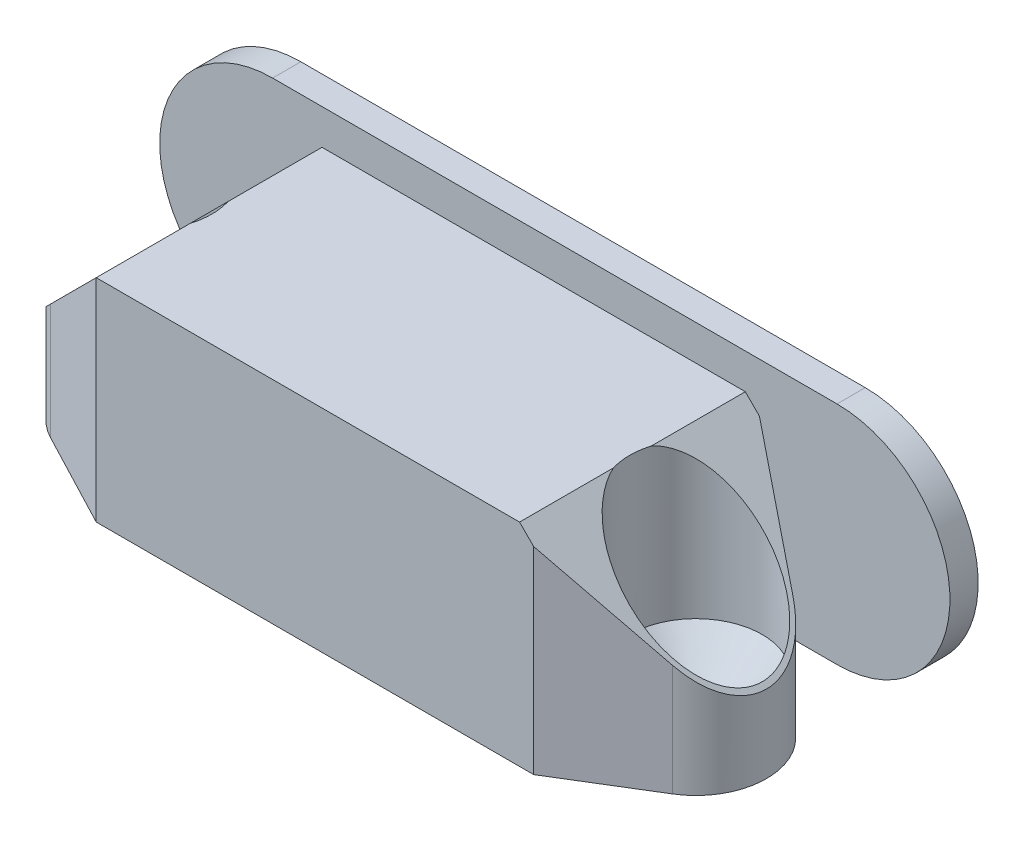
ISO-10303-21;
HEADER;
FILE_DESCRIPTION(('STEP AP214'),'2;1');
FILE_NAME('part.step','',(''),(''),'','','');
FILE_SCHEMA(('AUTOMOTIVE_DESIGN { 1 0 10303 214 1 1 1 1 }'));
ENDSEC;
DATA;
#1=APPLICATION_CONTEXT('core data for automotive mechanical design processes');
#2=APPLICATION_PROTOCOL_DEFINITION('international standard','automotive_design',2000,#1);
#3=PRODUCT_CONTEXT('',#1,'mechanical');
#4=PRODUCT('Part','Part','',(#3));
#5=PRODUCT_RELATED_PRODUCT_CATEGORY('part','',(#4));
#6=PRODUCT_DEFINITION_FORMATION('','',#4);
#7=PRODUCT_DEFINITION_CONTEXT('part definition',#1,'design');
#8=PRODUCT_DEFINITION('design','',#6,#7);
#9=PRODUCT_DEFINITION_SHAPE('','',#8);
#10=(LENGTH_UNIT() NAMED_UNIT(*) SI_UNIT(.MILLI.,.METRE.));
#11=(NAMED_UNIT(*) PLANE_ANGLE_UNIT() SI_UNIT($,.RADIAN.));
#12=(NAMED_UNIT(*) SI_UNIT($,.STERADIAN.) SOLID_ANGLE_UNIT());
#13=UNCERTAINTY_MEASURE_WITH_UNIT(LENGTH_MEASURE(1.E-05),#10,'distance_accuracy_value','');
#14=(GEOMETRIC_REPRESENTATION_CONTEXT(3) GLOBAL_UNCERTAINTY_ASSIGNED_CONTEXT((#13)) GLOBAL_UNIT_ASSIGNED_CONTEXT((#10,
#11,#12)) REPRESENTATION_CONTEXT('',''));
#15=CARTESIAN_POINT('',(0.,0.,0.));
#16=DIRECTION('',(0.,0.,1.));
#17=DIRECTION('',(1.,0.,0.));
#18=AXIS2_PLACEMENT_3D('',#15,#16,#17);
#19=CARTESIAN_POINT('',(16.,7.,19.5));
#20=DIRECTION('',(0.,0.,1.));
#21=DIRECTION('',(1.,0.,0.));
#22=AXIS2_PLACEMENT_3D('',#19,#20,#21);
#23=PLANE('',#22);
#24=DIRECTION('',(0.,-1.,0.));
#25=VECTOR('',#24,1.);
#26=CARTESIAN_POINT('',(16.,7.,19.5));
#27=LINE('',#26,#25);
#28=CARTESIAN_POINT('',(16.,6.,19.5));
#29=VERTEX_POINT('',#28);
#30=CARTESIAN_POINT('',(16.,-8.,19.5));
#31=VERTEX_POINT('',#30);
#32=EDGE_CURVE('E235',#29,#31,#27,.T.);
#33=ORIENTED_EDGE('',*,*,#32,.F.);
#34=DIRECTION('',(-0.707106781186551,0.707106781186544,0.));
#35=VECTOR('',#34,1.);
#36=CARTESIAN_POINT('',(15.,7.,19.5));
#37=LINE('',#36,#35);
#38=CARTESIAN_POINT('',(15.,7.,19.5));
#39=VERTEX_POINT('',#38);
#40=EDGE_CURVE('E150',#29,#39,#37,.T.);
#41=ORIENTED_EDGE('',*,*,#40,.T.);
#42=DIRECTION('',(-1.,0.,0.));
#43=VECTOR('',#42,1.);
#44=CARTESIAN_POINT('',(16.,7.,19.5));
#45=LINE('',#44,#43);
#46=CARTESIAN_POINT('',(-15.,7.,19.5));
#47=VERTEX_POINT('',#46);
#48=EDGE_CURVE('E222',#39,#47,#45,.T.);
#49=ORIENTED_EDGE('',*,*,#48,.T.);
#50=DIRECTION('',(0.,-1.,0.));
#51=VECTOR('',#50,1.);
#52=CARTESIAN_POINT('',(-15.,7.,19.5));
#53=LINE('',#52,#51);
#54=CARTESIAN_POINT('',(-15.,-8.,19.5));
#55=VERTEX_POINT('',#54);
#56=EDGE_CURVE('E232',#47,#55,#53,.T.);
#57=ORIENTED_EDGE('',*,*,#56,.T.);
#58=DIRECTION('',(-1.,0.,0.));
#59=VECTOR('',#58,1.);
#60=CARTESIAN_POINT('',(16.,-8.,19.5));
#61=LINE('',#60,#59);
#62=EDGE_CURVE('E207',#31,#55,#61,.T.);
#63=ORIENTED_EDGE('',*,*,#62,.F.);
#64=EDGE_LOOP('',(#33,#41,#49,#57,#63));
#65=FACE_BOUND('',#64,.T.);
#66=ADVANCED_FACE('F46',(#65),#23,.T.);
#67=CARTESIAN_POINT('',(22.1079530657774,7.,15.7659794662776));
#68=DIRECTION('',(0.521590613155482,0.,0.853195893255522));
#69=DIRECTION('',(0.853195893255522,0.,-0.521590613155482));
#70=AXIS2_PLACEMENT_3D('',#67,#68,#69);
#71=PLANE('',#70);
#72=DIRECTION('',(0.,-1.,0.));
#73=VECTOR('',#72,1.);
#74=CARTESIAN_POINT('',(22.1079530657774,7.,15.7659794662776));
#75=LINE('',#74,#73);
#76=CARTESIAN_POINT('',(22.1079530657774,-0.107953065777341,15.7659794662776));
#77=VERTEX_POINT('',#76);
#78=CARTESIAN_POINT('',(22.1079530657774,-8.,15.7659794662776));
#79=VERTEX_POINT('',#78);
#80=EDGE_CURVE('E238',#77,#79,#75,.T.);
#81=ORIENTED_EDGE('',*,*,#80,.F.);
#82=DIRECTION('',(0.649058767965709,-0.649058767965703,-0.396793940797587));
#83=VECTOR('',#82,1.);
#84=CARTESIAN_POINT('',(19.2783843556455,2.72161564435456,17.4958008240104));
#85=LINE('',#84,#83);
#86=EDGE_CURVE('E291',#29,#77,#85,.T.);
#87=ORIENTED_EDGE('',*,*,#86,.F.);
#88=ORIENTED_EDGE('',*,*,#32,.T.);
#89=DIRECTION('',(-0.853195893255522,0.,0.521590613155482));
#90=VECTOR('',#89,1.);
#91=CARTESIAN_POINT('',(22.1079530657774,-8.,15.7659794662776));
#92=LINE('',#91,#90);
#93=EDGE_CURVE('E203',#79,#31,#92,.T.);
#94=ORIENTED_EDGE('',*,*,#93,.F.);
#95=EDGE_LOOP('',(#81,#87,#88,#94));
#96=FACE_BOUND('',#95,.T.);
#97=ADVANCED_FACE('F288',(#96),#71,.T.);
#98=CARTESIAN_POINT('',(19.5,7.,11.5));
#99=DIRECTION('',(0.,-1.,0.));
#100=DIRECTION('',(1.,0.,0.));
#101=AXIS2_PLACEMENT_3D('',#98,#99,#100);
#102=CYLINDRICAL_SURFACE('',#101,5.);
#103=DIRECTION('',(0.,-1.,0.));
#104=VECTOR('',#103,1.);
#105=CARTESIAN_POINT('',(22.1079530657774,7.,7.23402053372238));
#106=LINE('',#105,#104);
#107=CARTESIAN_POINT('',(22.1079530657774,-0.107953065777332,7.23402053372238));
#108=VERTEX_POINT('',#107);
#109=CARTESIAN_POINT('',(22.1079530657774,-8.,7.23402053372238));
#110=VERTEX_POINT('',#109);
#111=EDGE_CURVE('E241',#108,#110,#106,.T.);
#112=ORIENTED_EDGE('',*,*,#111,.F.);
#113=CARTESIAN_POINT('',(19.5,2.50000000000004,11.5));
#114=DIRECTION('',(0.707106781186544,0.707106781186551,0.));
#115=DIRECTION('',(0.707106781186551,-0.707106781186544,0.));
#116=AXIS2_PLACEMENT_3D('',#113,#114,#115);
#117=ELLIPSE('',#116,7.07106781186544,5.);
#118=EDGE_CURVE('E155',#77,#108,#117,.T.);
#119=ORIENTED_EDGE('',*,*,#118,.F.);
#120=ORIENTED_EDGE('',*,*,#80,.T.);
#121=CARTESIAN_POINT('',(19.5,-8.,11.5));
#122=DIRECTION('',(0.,-1.,0.));
#123=DIRECTION('',(1.,0.,0.));
#124=AXIS2_PLACEMENT_3D('',#121,#122,#123);
#125=CIRCLE('',#124,5.);
#126=EDGE_CURVE('E199',#110,#79,#125,.T.);
#127=ORIENTED_EDGE('',*,*,#126,.F.);
#128=EDGE_LOOP('',(#112,#119,#120,#127));
#129=FACE_BOUND('',#128,.T.);
#130=ADVANCED_FACE('F283',(#129),#102,.T.);
#131=CARTESIAN_POINT('',(16.,7.,3.5));
#132=DIRECTION('',(0.52159061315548,0.,-0.853195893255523));
#133=DIRECTION('',(-0.853195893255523,0.,-0.52159061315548));
#134=AXIS2_PLACEMENT_3D('',#131,#132,#133);
#135=PLANE('',#134);
#136=DIRECTION('',(0.,-1.,0.));
#137=VECTOR('',#136,1.);
#138=CARTESIAN_POINT('',(16.,7.,3.5));
#139=LINE('',#138,#137);
#140=CARTESIAN_POINT('',(16.,6.00000000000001,3.5));
#141=VERTEX_POINT('',#140);
#142=CARTESIAN_POINT('',(16.,-8.,3.5));
#143=VERTEX_POINT('',#142);
#144=EDGE_CURVE('E244',#141,#143,#139,.T.);
#145=ORIENTED_EDGE('',*,*,#144,.F.);
#146=DIRECTION('',(-0.64905876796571,0.649058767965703,-0.396793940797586));
#147=VECTOR('',#146,1.);
#148=CARTESIAN_POINT('',(15.1571878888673,6.84281211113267,2.98475738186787));
#149=LINE('',#148,#147);
#150=EDGE_CURVE('E147',#108,#141,#149,.T.);
#151=ORIENTED_EDGE('',*,*,#150,.F.);
#152=ORIENTED_EDGE('',*,*,#111,.T.);
#153=DIRECTION('',(0.853195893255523,0.,0.52159061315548));
#154=VECTOR('',#153,1.);
#155=CARTESIAN_POINT('',(16.,-8.,3.5));
#156=LINE('',#155,#154);
#157=EDGE_CURVE('E195',#143,#110,#156,.T.);
#158=ORIENTED_EDGE('',*,*,#157,.F.);
#159=EDGE_LOOP('',(#145,#151,#152,#158));
#160=FACE_BOUND('',#159,.T.);
#161=ADVANCED_FACE('F278',(#160),#135,.T.);
#162=CARTESIAN_POINT('',(-15.,7.,3.5));
#163=DIRECTION('',(0.,0.,-1.));
#164=DIRECTION('',(-1.,0.,0.));
#165=AXIS2_PLACEMENT_3D('',#162,#163,#164);
#166=PLANE('',#165);
#167=DIRECTION('',(1.,0.,0.));
#168=VECTOR('',#167,1.);
#169=CARTESIAN_POINT('',(-15.,7.,3.5));
#170=LINE('',#169,#168);
#171=CARTESIAN_POINT('',(-15.,7.,3.5));
#172=VERTEX_POINT('',#171);
#173=CARTESIAN_POINT('',(15.,7.,3.5));
#174=VERTEX_POINT('',#173);
#175=EDGE_CURVE('E219',#172,#174,#170,.T.);
#176=ORIENTED_EDGE('',*,*,#175,.T.);
#177=DIRECTION('',(-0.707106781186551,0.707106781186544,0.));
#178=VECTOR('',#177,1.);
#179=CARTESIAN_POINT('',(15.,7.,3.5));
#180=LINE('',#179,#178);
#181=EDGE_CURVE('E69',#141,#174,#180,.T.);
#182=ORIENTED_EDGE('',*,*,#181,.F.);
#183=ORIENTED_EDGE('',*,*,#144,.T.);
#184=DIRECTION('',(1.,0.,0.));
#185=VECTOR('',#184,1.);
#186=CARTESIAN_POINT('',(-15.,-8.,3.5));
#187=LINE('',#186,#185);
#188=CARTESIAN_POINT('',(-15.,-8.,3.5));
#189=VERTEX_POINT('',#188);
#190=EDGE_CURVE('E191',#189,#143,#187,.T.);
#191=ORIENTED_EDGE('',*,*,#190,.F.);
#192=DIRECTION('',(0.,-1.,0.));
#193=VECTOR('',#192,1.);
#194=CARTESIAN_POINT('',(-15.,7.,3.5));
#195=LINE('',#194,#193);
#196=EDGE_CURVE('E225',#172,#189,#195,.T.);
#197=ORIENTED_EDGE('',*,*,#196,.F.);
#198=EDGE_LOOP('',(#176,#182,#183,#191,#197));
#199=FACE_BOUND('',#198,.T.);
#200=ADVANCED_FACE('F273',(#199),#166,.T.);
#201=CARTESIAN_POINT('',(19.5,7.,11.5));
#202=DIRECTION('',(0.,-1.,0.));
#203=DIRECTION('',(1.,0.,0.));
#204=AXIS2_PLACEMENT_3D('',#201,#202,#203);
#205=PLANE('',#204);
#206=DIRECTION('',(0.,0.,1.));
#207=VECTOR('',#206,1.);
#208=CARTESIAN_POINT('',(15.,7.,3.499));
#209=LINE('',#208,#207);
#210=CARTESIAN_POINT('',(15.,7.,12.8564659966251));
#211=VERTEX_POINT('',#210);
#212=EDGE_CURVE('E137',#211,#39,#209,.T.);
#213=ORIENTED_EDGE('',*,*,#212,.F.);
#214=CARTESIAN_POINT('',(19.5,7.,11.5));
#215=DIRECTION('',(0.,1.,0.));
#216=DIRECTION('',(0.,0.,1.));
#217=AXIS2_PLACEMENT_3D('',#214,#215,#216);
#218=CIRCLE('',#217,4.7);
#219=CARTESIAN_POINT('',(15.,7.,10.1435340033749));
#220=VERTEX_POINT('',#219);
#221=EDGE_CURVE('E61',#220,#211,#218,.T.);
#222=ORIENTED_EDGE('',*,*,#221,.F.);
#223=EDGE_CURVE('E134',#174,#220,#209,.T.);
#224=ORIENTED_EDGE('',*,*,#223,.F.);
#225=ORIENTED_EDGE('',*,*,#175,.F.);
#226=DIRECTION('',(0.,0.,1.));
#227=VECTOR('',#226,1.);
#228=CARTESIAN_POINT('',(-15.,7.,-0.001000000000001));
#229=LINE('',#228,#227);
#230=CARTESIAN_POINT('',(-15.,7.,10.1435340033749));
#231=VERTEX_POINT('',#230);
#232=EDGE_CURVE('E175',#172,#231,#229,.T.);
#233=ORIENTED_EDGE('',*,*,#232,.T.);
#234=CARTESIAN_POINT('',(-19.5,7.,11.5));
#235=DIRECTION('',(0.,1.,0.));
#236=DIRECTION('',(0.,0.,1.));
#237=AXIS2_PLACEMENT_3D('',#234,#235,#236);
#238=CIRCLE('',#237,4.7);
#239=CARTESIAN_POINT('',(-15.,7.,12.8564659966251));
#240=VERTEX_POINT('',#239);
#241=EDGE_CURVE('E158',#240,#231,#238,.T.);
#242=ORIENTED_EDGE('',*,*,#241,.F.);
#243=EDGE_CURVE('E174',#240,#47,#229,.T.);
#244=ORIENTED_EDGE('',*,*,#243,.T.);
#245=ORIENTED_EDGE('',*,*,#48,.F.);
#246=EDGE_LOOP('',(#213,#222,#224,#225,#233,#242,#244,#245));
#247=FACE_BOUND('',#246,.T.);
#248=ADVANCED_FACE('F132',(#247),#205,.F.);
#249=CARTESIAN_POINT('',(-21.8192413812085,7.,7.07042672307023));
#250=DIRECTION('',(-0.463848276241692,0.,-0.885914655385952));
#251=DIRECTION('',(-0.885914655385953,0.,0.463848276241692));
#252=AXIS2_PLACEMENT_3D('',#249,#250,#251);
#253=PLANE('',#252);
#254=DIRECTION('',(0.663119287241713,0.663119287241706,-0.347196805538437));
#255=VECTOR('',#254,1.);
#256=CARTESIAN_POINT('',(-14.1939546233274,7.80604537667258,3.07796977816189));
#257=LINE('',#256,#255);
#258=CARTESIAN_POINT('',(-21.8192413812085,0.180758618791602,7.07042672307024));
#259=VERTEX_POINT('',#258);
#260=EDGE_CURVE('E183',#259,#172,#257,.T.);
#261=ORIENTED_EDGE('',*,*,#260,.T.);
#262=ORIENTED_EDGE('',*,*,#196,.T.);
#263=DIRECTION('',(0.885914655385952,0.,-0.463848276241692));
#264=VECTOR('',#263,1.);
#265=CARTESIAN_POINT('',(-21.8192413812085,-8.,7.07042672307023));
#266=LINE('',#265,#264);
#267=CARTESIAN_POINT('',(-21.8192413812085,-8.,7.07042672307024));
#268=VERTEX_POINT('',#267);
#269=EDGE_CURVE('E187',#268,#189,#266,.T.);
#270=ORIENTED_EDGE('',*,*,#269,.F.);
#271=DIRECTION('',(0.,-1.,0.));
#272=VECTOR('',#271,1.);
#273=CARTESIAN_POINT('',(-21.8192413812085,7.,7.07042672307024));
#274=LINE('',#273,#272);
#275=EDGE_CURVE('E226',#259,#268,#274,.T.);
#276=ORIENTED_EDGE('',*,*,#275,.F.);
#277=EDGE_LOOP('',(#261,#262,#270,#276));
#278=FACE_BOUND('',#277,.T.);
#279=ADVANCED_FACE('F48',(#278),#253,.T.);
#280=CARTESIAN_POINT('',(-19.5,7.,11.5));
#281=DIRECTION('',(0.,-1.,0.));
#282=DIRECTION('',(1.,0.,0.));
#283=AXIS2_PLACEMENT_3D('',#280,#281,#282);
#284=CYLINDRICAL_SURFACE('',#283,5.);
#285=CARTESIAN_POINT('',(-19.5,2.50000000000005,11.5));
#286=DIRECTION('',(0.707106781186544,-0.707106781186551,0.));
#287=DIRECTION('',(-0.707106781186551,-0.707106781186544,0.));
#288=AXIS2_PLACEMENT_3D('',#285,#286,#287);
#289=ELLIPSE('',#288,7.07106781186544,5.);
#290=CARTESIAN_POINT('',(-21.8192413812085,0.180758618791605,15.9295732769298));
#291=VERTEX_POINT('',#290);
#292=EDGE_CURVE('E179',#291,#259,#289,.T.);
#293=ORIENTED_EDGE('',*,*,#292,.T.);
#294=ORIENTED_EDGE('',*,*,#275,.T.);
#295=CARTESIAN_POINT('',(-19.5,-8.,11.5));
#296=DIRECTION('',(0.,-1.,0.));
#297=DIRECTION('',(1.,0.,0.));
#298=AXIS2_PLACEMENT_3D('',#295,#296,#297);
#299=CIRCLE('',#298,5.);
#300=CARTESIAN_POINT('',(-21.8192413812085,-8.,15.9295732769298));
#301=VERTEX_POINT('',#300);
#302=EDGE_CURVE('E215',#301,#268,#299,.T.);
#303=ORIENTED_EDGE('',*,*,#302,.F.);
#304=DIRECTION('',(0.,-1.,0.));
#305=VECTOR('',#304,1.);
#306=CARTESIAN_POINT('',(-21.8192413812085,7.,15.9295732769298));
#307=LINE('',#306,#305);
#308=EDGE_CURVE('E229',#291,#301,#307,.T.);
#309=ORIENTED_EDGE('',*,*,#308,.F.);
#310=EDGE_LOOP('',(#293,#294,#303,#309));
#311=FACE_BOUND('',#310,.T.);
#312=ADVANCED_FACE('F299',(#311),#284,.T.);
#313=CARTESIAN_POINT('',(-15.,7.,19.5));
#314=DIRECTION('',(-0.463848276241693,0.,0.885914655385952));
#315=DIRECTION('',(0.885914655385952,0.,0.463848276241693));
#316=AXIS2_PLACEMENT_3D('',#313,#314,#315);
#317=PLANE('',#316);
#318=DIRECTION('',(-0.663119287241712,-0.663119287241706,-0.347196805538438));
#319=VECTOR('',#318,1.);
#320=CARTESIAN_POINT('',(-19.4897717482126,2.51022825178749,17.1492398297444));
#321=LINE('',#320,#319);
#322=EDGE_CURVE('E170',#47,#291,#321,.T.);
#323=ORIENTED_EDGE('',*,*,#322,.T.);
#324=ORIENTED_EDGE('',*,*,#308,.T.);
#325=DIRECTION('',(-0.885914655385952,0.,-0.463848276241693));
#326=VECTOR('',#325,1.);
#327=CARTESIAN_POINT('',(-15.,-8.,19.5));
#328=LINE('',#327,#326);
#329=EDGE_CURVE('E211',#55,#301,#328,.T.);
#330=ORIENTED_EDGE('',*,*,#329,.F.);
#331=ORIENTED_EDGE('',*,*,#56,.F.);
#332=EDGE_LOOP('',(#323,#324,#330,#331));
#333=FACE_BOUND('',#332,.T.);
#334=ADVANCED_FACE('F263',(#333),#317,.T.);
#335=CARTESIAN_POINT('',(19.5,-8.,11.5));
#336=DIRECTION('',(0.,-1.,0.));
#337=DIRECTION('',(1.,0.,0.));
#338=AXIS2_PLACEMENT_3D('',#335,#336,#337);
#339=PLANE('',#338);
#340=CARTESIAN_POINT('',(19.5,-8.,11.5));
#341=DIRECTION('',(0.,-1.,0.));
#342=DIRECTION('',(1.,0.,0.));
#343=AXIS2_PLACEMENT_3D('',#340,#341,#342);
#344=CIRCLE('',#343,2.15);
#345=CARTESIAN_POINT('',(21.65,-8.,11.5));
#346=VERTEX_POINT('',#345);
#347=EDGE_CURVE('E50',#346,#346,#344,.T.);
#348=ORIENTED_EDGE('',*,*,#347,.F.);
#349=EDGE_LOOP('',(#348));
#350=FACE_BOUND('',#349,.T.);
#351=CARTESIAN_POINT('',(-19.5,-8.,11.5));
#352=DIRECTION('',(0.,-1.,0.));
#353=DIRECTION('',(1.,0.,0.));
#354=AXIS2_PLACEMENT_3D('',#351,#352,#353);
#355=CIRCLE('',#354,2.15);
#356=CARTESIAN_POINT('',(-17.35,-8.,11.5));
#357=VERTEX_POINT('',#356);
#358=EDGE_CURVE('E169',#357,#357,#355,.T.);
#359=ORIENTED_EDGE('',*,*,#358,.F.);
#360=EDGE_LOOP('',(#359));
#361=FACE_BOUND('',#360,.T.);
#362=ORIENTED_EDGE('',*,*,#269,.T.);
#363=ORIENTED_EDGE('',*,*,#190,.T.);
#364=ORIENTED_EDGE('',*,*,#157,.T.);
#365=ORIENTED_EDGE('',*,*,#126,.T.);
#366=ORIENTED_EDGE('',*,*,#93,.T.);
#367=ORIENTED_EDGE('',*,*,#62,.T.);
#368=ORIENTED_EDGE('',*,*,#329,.T.);
#369=ORIENTED_EDGE('',*,*,#302,.T.);
#370=EDGE_LOOP('',(#362,#363,#364,#365,#366,#367,#368,#369));
#371=FACE_BOUND('',#370,.T.);
#372=ADVANCED_FACE('F259',(#350,#361,#371),#339,.T.);
#373=CARTESIAN_POINT('',(-15.,7.,-0.001000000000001));
#374=DIRECTION('',(0.707106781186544,-0.707106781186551,0.));
#375=DIRECTION('',(0.707106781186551,0.707106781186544,0.));
#376=AXIS2_PLACEMENT_3D('',#373,#374,#375);
#377=PLANE('',#376);
#378=ORIENTED_EDGE('',*,*,#243,.F.);
#379=CARTESIAN_POINT('',(-19.5,2.50000000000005,11.5));
#380=DIRECTION('',(0.707106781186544,-0.707106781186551,0.));
#381=DIRECTION('',(0.707106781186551,0.707106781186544,0.));
#382=AXIS2_PLACEMENT_3D('',#379,#380,#381);
#383=ELLIPSE('',#382,6.64680374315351,4.7);
#384=EDGE_CURVE('E56',#240,#231,#383,.T.);
#385=ORIENTED_EDGE('',*,*,#384,.T.);
#386=ORIENTED_EDGE('',*,*,#232,.F.);
#387=ORIENTED_EDGE('',*,*,#260,.F.);
#388=ORIENTED_EDGE('',*,*,#292,.F.);
#389=ORIENTED_EDGE('',*,*,#322,.F.);
#390=EDGE_LOOP('',(#378,#385,#386,#387,#388,#389));
#391=FACE_BOUND('',#390,.T.);
#392=ADVANCED_FACE('F262',(#391),#377,.F.);
#393=CARTESIAN_POINT('',(-19.5,7.,11.5));
#394=DIRECTION('',(0.,1.,0.));
#395=DIRECTION('',(0.,0.,1.));
#396=AXIS2_PLACEMENT_3D('',#393,#394,#395);
#397=CYLINDRICAL_SURFACE('',#396,4.7);
#398=CARTESIAN_POINT('',(-19.5,-4.,11.5));
#399=DIRECTION('',(0.,1.,0.));
#400=DIRECTION('',(0.,0.,1.));
#401=AXIS2_PLACEMENT_3D('',#398,#399,#400);
#402=CIRCLE('',#401,4.7);
#403=CARTESIAN_POINT('',(-19.5,-4.,16.2));
#404=VERTEX_POINT('',#403);
#405=EDGE_CURVE('E161',#404,#404,#402,.T.);
#406=ORIENTED_EDGE('',*,*,#405,.F.);
#407=EDGE_LOOP('',(#406));
#408=FACE_BOUND('',#407,.T.);
#409=ORIENTED_EDGE('',*,*,#241,.T.);
#410=ORIENTED_EDGE('',*,*,#384,.F.);
#411=EDGE_LOOP('',(#409,#410));
#412=FACE_BOUND('',#411,.T.);
#413=ADVANCED_FACE('F330',(#408,#412),#397,.F.);
#414=CARTESIAN_POINT('',(-19.5,7.,11.5));
#415=DIRECTION('',(0.,1.,0.));
#416=DIRECTION('',(0.,0.,1.));
#417=AXIS2_PLACEMENT_3D('',#414,#415,#416);
#418=CYLINDRICAL_SURFACE('',#417,2.15);
#419=ORIENTED_EDGE('',*,*,#358,.T.);
#420=EDGE_LOOP('',(#419));
#421=FACE_BOUND('',#420,.T.);
#422=CARTESIAN_POINT('',(-19.5,-6.55,11.5));
#423=DIRECTION('',(0.,1.,0.));
#424=DIRECTION('',(0.,0.,1.));
#425=AXIS2_PLACEMENT_3D('',#422,#423,#424);
#426=CIRCLE('',#425,2.15000000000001);
#427=CARTESIAN_POINT('',(-19.5,-6.55,13.65));
#428=VERTEX_POINT('',#427);
#429=EDGE_CURVE('E165',#428,#428,#426,.T.);
#430=ORIENTED_EDGE('',*,*,#429,.T.);
#431=EDGE_LOOP('',(#430));
#432=FACE_BOUND('',#431,.T.);
#433=ADVANCED_FACE('F256',(#421,#432),#418,.F.);
#434=CARTESIAN_POINT('',(-19.5,-4.,11.5));
#435=DIRECTION('',(0.,1.,0.));
#436=DIRECTION('',(0.,0.,1.));
#437=AXIS2_PLACEMENT_3D('',#434,#435,#436);
#438=CONICAL_SURFACE('',#437,4.7,0.785398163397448);
#439=ORIENTED_EDGE('',*,*,#429,.F.);
#440=EDGE_LOOP('',(#439));
#441=FACE_BOUND('',#440,.T.);
#442=ORIENTED_EDGE('',*,*,#405,.T.);
#443=EDGE_LOOP('',(#442));
#444=FACE_BOUND('',#443,.T.);
#445=ADVANCED_FACE('F333',(#441,#444),#438,.F.);
#446=CARTESIAN_POINT('',(15.,7.,3.499));
#447=DIRECTION('',(0.707106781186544,0.707106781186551,0.));
#448=DIRECTION('',(-0.707106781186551,0.707106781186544,0.));
#449=AXIS2_PLACEMENT_3D('',#446,#447,#448);
#450=PLANE('',#449);
#451=CARTESIAN_POINT('',(19.5,2.50000000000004,11.5));
#452=DIRECTION('',(0.707106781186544,0.707106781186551,0.));
#453=DIRECTION('',(-0.707106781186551,0.707106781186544,0.));
#454=AXIS2_PLACEMENT_3D('',#451,#452,#453);
#455=ELLIPSE('',#454,6.64680374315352,4.7);
#456=EDGE_CURVE('E12',#211,#220,#455,.T.);
#457=ORIENTED_EDGE('',*,*,#456,.F.);
#458=ORIENTED_EDGE('',*,*,#212,.T.);
#459=ORIENTED_EDGE('',*,*,#40,.F.);
#460=ORIENTED_EDGE('',*,*,#86,.T.);
#461=ORIENTED_EDGE('',*,*,#118,.T.);
#462=ORIENTED_EDGE('',*,*,#150,.T.);
#463=ORIENTED_EDGE('',*,*,#181,.T.);
#464=ORIENTED_EDGE('',*,*,#223,.T.);
#465=EDGE_LOOP('',(#457,#458,#459,#460,#461,#462,#463,#464));
#466=FACE_BOUND('',#465,.T.);
#467=ADVANCED_FACE('F141',(#466),#450,.T.);
#468=CARTESIAN_POINT('',(19.5,7.,11.5));
#469=DIRECTION('',(0.,1.,0.));
#470=DIRECTION('',(0.,0.,1.));
#471=AXIS2_PLACEMENT_3D('',#468,#469,#470);
#472=CYLINDRICAL_SURFACE('',#471,2.15);
#473=ORIENTED_EDGE('',*,*,#347,.T.);
#474=EDGE_LOOP('',(#473));
#475=FACE_BOUND('',#474,.T.);
#476=CARTESIAN_POINT('',(19.5,-6.55,11.5));
#477=DIRECTION('',(0.,1.,0.));
#478=DIRECTION('',(0.,0.,1.));
#479=AXIS2_PLACEMENT_3D('',#476,#477,#478);
#480=CIRCLE('',#479,2.15000000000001);
#481=CARTESIAN_POINT('',(19.5,-6.55,13.65));
#482=VERTEX_POINT('',#481);
#483=EDGE_CURVE('E472',#482,#482,#480,.T.);
#484=ORIENTED_EDGE('',*,*,#483,.T.);
#485=EDGE_LOOP('',(#484));
#486=FACE_BOUND('',#485,.T.);
#487=ADVANCED_FACE('F342',(#475,#486),#472,.F.);
#488=CARTESIAN_POINT('',(19.5,-4.,11.5));
#489=DIRECTION('',(0.,1.,0.));
#490=DIRECTION('',(0.,0.,1.));
#491=AXIS2_PLACEMENT_3D('',#488,#489,#490);
#492=CONICAL_SURFACE('',#491,4.7,0.785398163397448);
#493=ORIENTED_EDGE('',*,*,#483,.F.);
#494=EDGE_LOOP('',(#493));
#495=FACE_BOUND('',#494,.T.);
#496=CARTESIAN_POINT('',(19.5,-4.,11.5));
#497=DIRECTION('',(0.,1.,0.));
#498=DIRECTION('',(0.,0.,1.));
#499=AXIS2_PLACEMENT_3D('',#496,#497,#498);
#500=CIRCLE('',#499,4.7);
#501=CARTESIAN_POINT('',(19.5,-4.,16.2));
#502=VERTEX_POINT('',#501);
#503=EDGE_CURVE('E139',#502,#502,#500,.T.);
#504=ORIENTED_EDGE('',*,*,#503,.T.);
#505=EDGE_LOOP('',(#504));
#506=FACE_BOUND('',#505,.T.);
#507=ADVANCED_FACE('F345',(#495,#506),#492,.F.);
#508=CARTESIAN_POINT('',(19.5,7.,11.5));
#509=DIRECTION('',(0.,1.,0.));
#510=DIRECTION('',(0.,0.,1.));
#511=AXIS2_PLACEMENT_3D('',#508,#509,#510);
#512=CYLINDRICAL_SURFACE('',#511,4.7);
#513=ORIENTED_EDGE('',*,*,#456,.T.);
#514=ORIENTED_EDGE('',*,*,#221,.T.);
#515=EDGE_LOOP('',(#513,#514));
#516=FACE_BOUND('',#515,.T.);
#517=ORIENTED_EDGE('',*,*,#503,.F.);
#518=EDGE_LOOP('',(#517));
#519=FACE_BOUND('',#518,.T.);
#520=ADVANCED_FACE('F128',(#516,#519),#512,.F.);
#521=CLOSED_SHELL('',(#66,#97,#130,#161,#200,#248,#279,#312,#334,#372,#392,#413,#433,#445,#467,
#487,#507,#520));
#522=MANIFOLD_SOLID_BREP('B2',#521);
#523=CARTESIAN_POINT('',(-20.,0.,2.));
#524=DIRECTION('',(0.,0.,-1.));
#525=DIRECTION('',(-1.,0.,0.));
#526=AXIS2_PLACEMENT_3D('',#523,#524,#525);
#527=CYLINDRICAL_SURFACE('',#526,8.);
#528=CARTESIAN_POINT('',(-20.,0.,0.));
#529=DIRECTION('',(0.,0.,1.));
#530=DIRECTION('',(1.,0.,0.));
#531=AXIS2_PLACEMENT_3D('',#528,#529,#530);
#532=CIRCLE('',#531,8.);
#533=CARTESIAN_POINT('',(-20.,8.,0.));
#534=VERTEX_POINT('',#533);
#535=CARTESIAN_POINT('',(-20.,-8.,0.));
#536=VERTEX_POINT('',#535);
#537=EDGE_CURVE('E538',#534,#536,#532,.T.);
#538=ORIENTED_EDGE('',*,*,#537,.T.);
#539=DIRECTION('',(0.,0.,-1.));
#540=VECTOR('',#539,1.);
#541=CARTESIAN_POINT('',(-20.,-8.,2.));
#542=LINE('',#541,#540);
#543=CARTESIAN_POINT('',(-20.,-8.,2.));
#544=VERTEX_POINT('',#543);
#545=EDGE_CURVE('E44',#544,#536,#542,.T.);
#546=ORIENTED_EDGE('',*,*,#545,.F.);
#547=CARTESIAN_POINT('',(-20.,0.,2.));
#548=DIRECTION('',(0.,0.,1.));
#549=DIRECTION('',(1.,0.,0.));
#550=AXIS2_PLACEMENT_3D('',#547,#548,#549);
#551=CIRCLE('',#550,8.);
#552=CARTESIAN_POINT('',(-20.,8.,2.));
#553=VERTEX_POINT('',#552);
#554=EDGE_CURVE('E562',#553,#544,#551,.T.);
#555=ORIENTED_EDGE('',*,*,#554,.F.);
#556=DIRECTION('',(0.,0.,-1.));
#557=VECTOR('',#556,1.);
#558=CARTESIAN_POINT('',(-20.,8.,2.));
#559=LINE('',#558,#557);
#560=EDGE_CURVE('E551',#553,#534,#559,.T.);
#561=ORIENTED_EDGE('',*,*,#560,.T.);
#562=EDGE_LOOP('',(#538,#546,#555,#561));
#563=FACE_BOUND('',#562,.T.);
#564=ADVANCED_FACE('F493',(#563),#527,.T.);
#565=CARTESIAN_POINT('',(-20.,-8.,2.));
#566=DIRECTION('',(0.,1.,0.));
#567=DIRECTION('',(-1.,0.,0.));
#568=AXIS2_PLACEMENT_3D('',#565,#566,#567);
#569=PLANE('',#568);
#570=DIRECTION('',(1.,0.,0.));
#571=VECTOR('',#570,1.);
#572=CARTESIAN_POINT('',(-20.,-8.,0.));
#573=LINE('',#572,#571);
#574=CARTESIAN_POINT('',(20.,-8.,0.));
#575=VERTEX_POINT('',#574);
#576=EDGE_CURVE('E534',#536,#575,#573,.T.);
#577=ORIENTED_EDGE('',*,*,#576,.T.);
#578=DIRECTION('',(0.,0.,-1.));
#579=VECTOR('',#578,1.);
#580=CARTESIAN_POINT('',(20.,-8.,2.));
#581=LINE('',#580,#579);
#582=CARTESIAN_POINT('',(20.,-8.,2.));
#583=VERTEX_POINT('',#582);
#584=EDGE_CURVE('E501',#583,#575,#581,.T.);
#585=ORIENTED_EDGE('',*,*,#584,.F.);
#586=DIRECTION('',(1.,0.,0.));
#587=VECTOR('',#586,1.);
#588=CARTESIAN_POINT('',(-20.,-8.,2.));
#589=LINE('',#588,#587);
#590=EDGE_CURVE('E547',#544,#583,#589,.T.);
#591=ORIENTED_EDGE('',*,*,#590,.F.);
#592=ORIENTED_EDGE('',*,*,#545,.T.);
#593=EDGE_LOOP('',(#577,#585,#591,#592));
#594=FACE_BOUND('',#593,.T.);
#595=ADVANCED_FACE('F546',(#594),#569,.F.);
#596=CARTESIAN_POINT('',(20.,0.,2.));
#597=DIRECTION('',(0.,0.,-1.));
#598=DIRECTION('',(-1.,0.,0.));
#599=AXIS2_PLACEMENT_3D('',#596,#597,#598);
#600=CYLINDRICAL_SURFACE('',#599,8.);
#601=CARTESIAN_POINT('',(20.,0.,0.));
#602=DIRECTION('',(0.,0.,1.));
#603=DIRECTION('',(1.,0.,0.));
#604=AXIS2_PLACEMENT_3D('',#601,#602,#603);
#605=CIRCLE('',#604,8.);
#606=CARTESIAN_POINT('',(20.,8.,0.));
#607=VERTEX_POINT('',#606);
#608=EDGE_CURVE('E539',#575,#607,#605,.T.);
#609=ORIENTED_EDGE('',*,*,#608,.T.);
#610=DIRECTION('',(0.,0.,-1.));
#611=VECTOR('',#610,1.);
#612=CARTESIAN_POINT('',(20.,8.,2.));
#613=LINE('',#612,#611);
#614=CARTESIAN_POINT('',(20.,8.,2.));
#615=VERTEX_POINT('',#614);
#616=EDGE_CURVE('E573',#615,#607,#613,.T.);
#617=ORIENTED_EDGE('',*,*,#616,.F.);
#618=CARTESIAN_POINT('',(20.,0.,2.));
#619=DIRECTION('',(0.,0.,1.));
#620=DIRECTION('',(1.,0.,0.));
#621=AXIS2_PLACEMENT_3D('',#618,#619,#620);
#622=CIRCLE('',#621,8.);
#623=EDGE_CURVE('E513',#583,#615,#622,.T.);
#624=ORIENTED_EDGE('',*,*,#623,.F.);
#625=ORIENTED_EDGE('',*,*,#584,.T.);
#626=EDGE_LOOP('',(#609,#617,#624,#625));
#627=FACE_BOUND('',#626,.T.);
#628=ADVANCED_FACE('F576',(#627),#600,.T.);
#629=CARTESIAN_POINT('',(20.,8.00000000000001,2.));
#630=DIRECTION('',(0.,-1.,0.));
#631=DIRECTION('',(1.,0.,0.));
#632=AXIS2_PLACEMENT_3D('',#629,#630,#631);
#633=PLANE('',#632);
#634=DIRECTION('',(-1.,0.,0.));
#635=VECTOR('',#634,1.);
#636=CARTESIAN_POINT('',(20.,8.00000000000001,0.));
#637=LINE('',#636,#635);
#638=EDGE_CURVE('E559',#607,#534,#637,.T.);
#639=ORIENTED_EDGE('',*,*,#638,.T.);
#640=ORIENTED_EDGE('',*,*,#560,.F.);
#641=DIRECTION('',(-1.,0.,0.));
#642=VECTOR('',#641,1.);
#643=CARTESIAN_POINT('',(20.,8.00000000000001,2.));
#644=LINE('',#643,#642);
#645=EDGE_CURVE('E508',#615,#553,#644,.T.);
#646=ORIENTED_EDGE('',*,*,#645,.F.);
#647=ORIENTED_EDGE('',*,*,#616,.T.);
#648=EDGE_LOOP('',(#639,#640,#646,#647));
#649=FACE_BOUND('',#648,.T.);
#650=ADVANCED_FACE('F578',(#649),#633,.F.);
#651=CARTESIAN_POINT('',(-20.,0.,2.));
#652=DIRECTION('',(0.,0.,1.));
#653=DIRECTION('',(1.,0.,0.));
#654=AXIS2_PLACEMENT_3D('',#651,#652,#653);
#655=PLANE('',#654);
#656=ORIENTED_EDGE('',*,*,#554,.T.);
#657=ORIENTED_EDGE('',*,*,#590,.T.);
#658=ORIENTED_EDGE('',*,*,#623,.T.);
#659=ORIENTED_EDGE('',*,*,#645,.T.);
#660=EDGE_LOOP('',(#656,#657,#658,#659));
#661=FACE_BOUND('',#660,.T.);
#662=ADVANCED_FACE('F579',(#661),#655,.T.);
#663=CARTESIAN_POINT('',(-20.,0.,0.));
#664=DIRECTION('',(0.,0.,1.));
#665=DIRECTION('',(1.,0.,0.));
#666=AXIS2_PLACEMENT_3D('',#663,#664,#665);
#667=PLANE('',#666);
#668=ORIENTED_EDGE('',*,*,#537,.F.);
#669=ORIENTED_EDGE('',*,*,#638,.F.);
#670=ORIENTED_EDGE('',*,*,#608,.F.);
#671=ORIENTED_EDGE('',*,*,#576,.F.);
#672=EDGE_LOOP('',(#668,#669,#670,#671));
#673=FACE_BOUND('',#672,.T.);
#674=ADVANCED_FACE('F535',(#673),#667,.F.);
#675=CLOSED_SHELL('',(#564,#595,#628,#650,#662,#674));
#676=MANIFOLD_SOLID_BREP('B6_NOT_SHOWN',#675);
#677=ADVANCED_BREP_SHAPE_REPRESENTATION('',(#18,#522,#676),#14);
#678=SHAPE_DEFINITION_REPRESENTATION(#9,#677);
ENDSEC;
END-ISO-10303-21;
